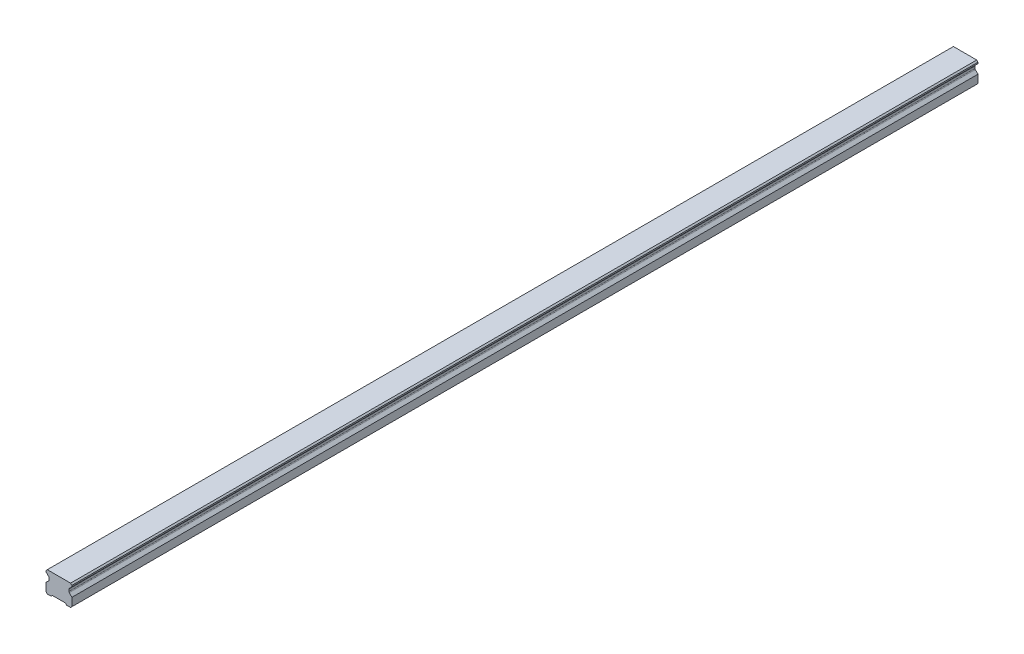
from build123d import *

# Parameters (mm, degrees)
SKETCH1_W           = 20
SKETCH1_H           = 16.3
BOSS_EXTRUDE1_DEPTH = 350
CUT_EXTRUDE1_DEPTH  = 701.261158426
CHAMFER1_SIZE       = 1
FILLET1_R           = 1
CUT_EXTRUDE2_DEPTH  = 701.261158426
SKETCH5_R           = 3
SKETCH5_R_2         = 2.5
CUT_EXTRUDE5_DEPTH  = 10
SKETCH5_2_R         = 2.5
CUT_EXTRUDE6_DEPTH  = 13
LPATTERN2_COUNT     = 12
LPATTERN2_PITCH     = 60


with BuildPart() as part:
    # Sketch1 → Boss-Extrude1 (new, symmetric)
    with BuildSketch(Plane.XY):
        with Locations((0, 8.15)):
            Rectangle(SKETCH1_W, SKETCH1_H)
    extrude(amount=BOSS_EXTRUDE1_DEPTH, both=True)

    # Sketch2 → Cut-Extrude1 (cut, through all)
    with BuildSketch(Plane.XY.offset(350)):
        Polygon((-10, 14.3), (-10, 7.3), (-7.666666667, 9.633333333), (-7.666666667, 11.966666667), align=None)
        Polygon((7.666666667, 11.966666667), (10, 14.3), (10, 7.3), (7.666666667, 9.633333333), align=None)
    extrude(amount=-CUT_EXTRUDE1_DEPTH, mode=Mode.SUBTRACT)

    # Chamfer1
    chamfer1_edges = [part.edges().sort_by_distance(p)[0] for p in [
        (-10, 16.3, 0),
        (10, 16.3, 0),
        (10, 0, 0),
        (-10, 0, 0),
    ]]
    chamfer(chamfer1_edges, length=CHAMFER1_SIZE)

    # Fillet1
    fillet1_edges = [part.edges().sort_by_distance(p)[0] for p in [
        (-7.666666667, 11.966666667, 0),
        (-7.666666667, 9.633333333, 0),
        (7.666666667, 9.633333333, 0),
        (7.666666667, 11.966666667, 0),
    ]]
    fillet(fillet1_edges, radius=FILLET1_R)

    # Sketch3 → Cut-Extrude2 (cut, through all)
    with BuildSketch(Plane.XY.offset(350)):
        Polygon((-6, 0), (-5, 1), (5, 1), (6, 0), align=None)
    extrude(amount=-CUT_EXTRUDE2_DEPTH, mode=Mode.SUBTRACT)

    # Sketch5 → Cut-Extrude5 (cut)
    with BuildSketch(Plane.XZ.offset(-1)):
        with Locations(Location((0, 330, 0), (0, 0, 270))):
            Circle(SKETCH5_R)
        with Locations(Location((0, 330, 0), (0, 0, 270))):
            Circle(SKETCH5_R_2, mode=Mode.SUBTRACT)
    cut_extrude5 = extrude(amount=-CUT_EXTRUDE5_DEPTH, mode=Mode.SUBTRACT)

    # Sketch5_2 → Cut-Extrude6 (cut)
    with BuildSketch(Plane.XZ.offset(-1)):
        with Locations(Location((0, 330, 0), (0, 0, 270))):
            Circle(SKETCH5_2_R)
    cut_extrude6 = extrude(amount=-CUT_EXTRUDE6_DEPTH, mode=Mode.SUBTRACT)

    # Cut-Extrude7 cone 1 section (on through the dimple's axis) → Cut-Extrude7 (revolve, cut)
    with BuildSketch(Plane(origin=(0, 14, 330), x_dir=(0, 0, -1), z_dir=(1, 0, 0))):
        Polygon((0, 0), (2.5, 0), (0, 1.443375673), align=None)
    cut_extrude7 = revolve(axis=Axis((0, 14, 330), (0, 1, 0)), mode=Mode.SUBTRACT)

    # LPattern2: Cut-Extrude5, Cut-Extrude6, Cut-Extrude7 ×12
    with Locations(*[(0, 0, -i * LPATTERN2_PITCH) for i in range(1, LPATTERN2_COUNT)]):
        add(cut_extrude5, mode=Mode.SUBTRACT)
        add(cut_extrude6, mode=Mode.SUBTRACT)
        add(cut_extrude7, mode=Mode.SUBTRACT)


solid = part.part
